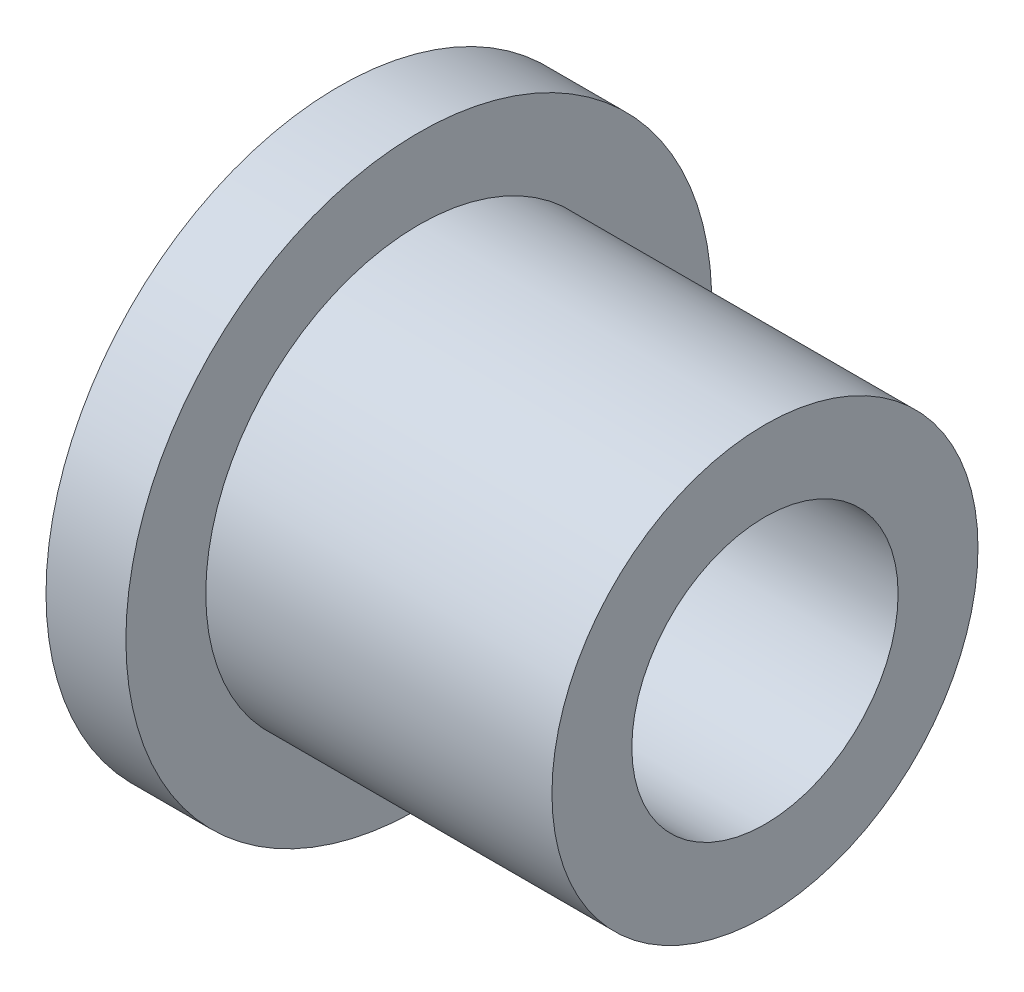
ISO-10303-21;
HEADER;
FILE_DESCRIPTION(('STEP AP214'),'2;1');
FILE_NAME('part.step','',(''),(''),'','','');
FILE_SCHEMA(('AUTOMOTIVE_DESIGN { 1 0 10303 214 1 1 1 1 }'));
ENDSEC;
DATA;
#1=APPLICATION_CONTEXT('core data for automotive mechanical design processes');
#2=APPLICATION_PROTOCOL_DEFINITION('international standard','automotive_design',2000,#1);
#3=PRODUCT_CONTEXT('',#1,'mechanical');
#4=PRODUCT('Part','Part','',(#3));
#5=PRODUCT_RELATED_PRODUCT_CATEGORY('part','',(#4));
#6=PRODUCT_DEFINITION_FORMATION('','',#4);
#7=PRODUCT_DEFINITION_CONTEXT('part definition',#1,'design');
#8=PRODUCT_DEFINITION('design','',#6,#7);
#9=PRODUCT_DEFINITION_SHAPE('','',#8);
#10=(LENGTH_UNIT() NAMED_UNIT(*) SI_UNIT(.MILLI.,.METRE.));
#11=(NAMED_UNIT(*) PLANE_ANGLE_UNIT() SI_UNIT($,.RADIAN.));
#12=(NAMED_UNIT(*) SI_UNIT($,.STERADIAN.) SOLID_ANGLE_UNIT());
#13=UNCERTAINTY_MEASURE_WITH_UNIT(LENGTH_MEASURE(1.E-05),#10,'distance_accuracy_value','');
#14=(GEOMETRIC_REPRESENTATION_CONTEXT(3) GLOBAL_UNCERTAINTY_ASSIGNED_CONTEXT((#13)) GLOBAL_UNIT_ASSIGNED_CONTEXT((#10,
#11,#12)) REPRESENTATION_CONTEXT('',''));
#15=CARTESIAN_POINT('',(0.,0.,0.));
#16=DIRECTION('',(0.,0.,1.));
#17=DIRECTION('',(1.,0.,0.));
#18=AXIS2_PLACEMENT_3D('',#15,#16,#17);
#19=CARTESIAN_POINT('',(-88.99,0.,0.));
#20=DIRECTION('',(-1.,0.,0.));
#21=DIRECTION('',(0.,0.,0.999999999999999));
#22=AXIS2_PLACEMENT_3D('',#19,#20,#21);
#23=CYLINDRICAL_SURFACE('',#22,11.);
#24=CARTESIAN_POINT('',(0.,0.,0.));
#25=DIRECTION('',(-1.,0.,0.));
#26=DIRECTION('',(0.,0.,0.999999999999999));
#27=AXIS2_PLACEMENT_3D('',#24,#25,#26);
#28=CIRCLE('',#27,11.);
#29=CARTESIAN_POINT('',(0.,0.,11.));
#30=VERTEX_POINT('',#29);
#31=EDGE_CURVE('E12',#30,#30,#28,.T.);
#32=ORIENTED_EDGE('',*,*,#31,.F.);
#33=EDGE_LOOP('',(#32));
#34=FACE_BOUND('',#33,.T.);
#35=CARTESIAN_POINT('',(3.,0.,0.));
#36=DIRECTION('',(-1.,0.,0.));
#37=DIRECTION('',(0.,0.,0.999999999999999));
#38=AXIS2_PLACEMENT_3D('',#35,#36,#37);
#39=CIRCLE('',#38,11.);
#40=CARTESIAN_POINT('',(3.,0.,11.));
#41=VERTEX_POINT('',#40);
#42=EDGE_CURVE('E60',#41,#41,#39,.T.);
#43=ORIENTED_EDGE('',*,*,#42,.T.);
#44=EDGE_LOOP('',(#43));
#45=FACE_BOUND('',#44,.T.);
#46=ADVANCED_FACE('F38',(#34,#45),#23,.T.);
#47=CARTESIAN_POINT('',(0.,11.,0.));
#48=DIRECTION('',(1.,0.,0.));
#49=DIRECTION('',(0.,0.,-0.999999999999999));
#50=AXIS2_PLACEMENT_3D('',#47,#48,#49);
#51=PLANE('',#50);
#52=CARTESIAN_POINT('',(0.,0.,0.));
#53=DIRECTION('',(-1.,0.,0.));
#54=DIRECTION('',(0.,0.,0.999999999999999));
#55=AXIS2_PLACEMENT_3D('',#52,#53,#54);
#56=CIRCLE('',#55,5.);
#57=CARTESIAN_POINT('',(0.,0.,4.99999999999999));
#58=VERTEX_POINT('',#57);
#59=EDGE_CURVE('E44',#58,#58,#56,.T.);
#60=ORIENTED_EDGE('',*,*,#59,.F.);
#61=EDGE_LOOP('',(#60));
#62=FACE_BOUND('',#61,.T.);
#63=ORIENTED_EDGE('',*,*,#31,.T.);
#64=EDGE_LOOP('',(#63));
#65=FACE_BOUND('',#64,.T.);
#66=ADVANCED_FACE('F85',(#62,#65),#51,.F.);
#67=CARTESIAN_POINT('',(-88.99,0.,0.));
#68=DIRECTION('',(-1.,0.,0.));
#69=DIRECTION('',(0.,0.,0.999999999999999));
#70=AXIS2_PLACEMENT_3D('',#67,#68,#69);
#71=CYLINDRICAL_SURFACE('',#70,5.);
#72=CARTESIAN_POINT('',(16.,0.,0.));
#73=DIRECTION('',(-1.,0.,0.));
#74=DIRECTION('',(0.,0.,0.999999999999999));
#75=AXIS2_PLACEMENT_3D('',#72,#73,#74);
#76=CIRCLE('',#75,5.);
#77=CARTESIAN_POINT('',(16.,0.,4.99999999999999));
#78=VERTEX_POINT('',#77);
#79=EDGE_CURVE('E48',#78,#78,#76,.T.);
#80=ORIENTED_EDGE('',*,*,#79,.F.);
#81=EDGE_LOOP('',(#80));
#82=FACE_BOUND('',#81,.T.);
#83=ORIENTED_EDGE('',*,*,#59,.T.);
#84=EDGE_LOOP('',(#83));
#85=FACE_BOUND('',#84,.T.);
#86=ADVANCED_FACE('F80',(#82,#85),#71,.F.);
#87=CARTESIAN_POINT('',(16.,5.,0.));
#88=DIRECTION('',(-1.,0.,0.));
#89=DIRECTION('',(0.,0.,0.999999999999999));
#90=AXIS2_PLACEMENT_3D('',#87,#88,#89);
#91=PLANE('',#90);
#92=CARTESIAN_POINT('',(16.,0.,0.));
#93=DIRECTION('',(-1.,0.,0.));
#94=DIRECTION('',(0.,0.,0.999999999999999));
#95=AXIS2_PLACEMENT_3D('',#92,#93,#94);
#96=CIRCLE('',#95,8.);
#97=CARTESIAN_POINT('',(16.,0.,7.99999999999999));
#98=VERTEX_POINT('',#97);
#99=EDGE_CURVE('E52',#98,#98,#96,.T.);
#100=ORIENTED_EDGE('',*,*,#99,.F.);
#101=EDGE_LOOP('',(#100));
#102=FACE_BOUND('',#101,.T.);
#103=ORIENTED_EDGE('',*,*,#79,.T.);
#104=EDGE_LOOP('',(#103));
#105=FACE_BOUND('',#104,.T.);
#106=ADVANCED_FACE('F74',(#102,#105),#91,.F.);
#107=CARTESIAN_POINT('',(-88.99,0.,0.));
#108=DIRECTION('',(-1.,0.,0.));
#109=DIRECTION('',(0.,0.,0.999999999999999));
#110=AXIS2_PLACEMENT_3D('',#107,#108,#109);
#111=CYLINDRICAL_SURFACE('',#110,8.);
#112=CARTESIAN_POINT('',(3.,0.,0.));
#113=DIRECTION('',(-1.,0.,0.));
#114=DIRECTION('',(0.,0.,0.999999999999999));
#115=AXIS2_PLACEMENT_3D('',#112,#113,#114);
#116=CIRCLE('',#115,8.);
#117=CARTESIAN_POINT('',(3.,0.,7.99999999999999));
#118=VERTEX_POINT('',#117);
#119=EDGE_CURVE('E57',#118,#118,#116,.T.);
#120=ORIENTED_EDGE('',*,*,#119,.F.);
#121=EDGE_LOOP('',(#120));
#122=FACE_BOUND('',#121,.T.);
#123=ORIENTED_EDGE('',*,*,#99,.T.);
#124=EDGE_LOOP('',(#123));
#125=FACE_BOUND('',#124,.T.);
#126=ADVANCED_FACE('F68',(#122,#125),#111,.T.);
#127=CARTESIAN_POINT('',(3.,8.,0.));
#128=DIRECTION('',(-1.,0.,0.));
#129=DIRECTION('',(0.,0.,0.999999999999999));
#130=AXIS2_PLACEMENT_3D('',#127,#128,#129);
#131=PLANE('',#130);
#132=ORIENTED_EDGE('',*,*,#42,.F.);
#133=EDGE_LOOP('',(#132));
#134=FACE_BOUND('',#133,.T.);
#135=ORIENTED_EDGE('',*,*,#119,.T.);
#136=EDGE_LOOP('',(#135));
#137=FACE_BOUND('',#136,.T.);
#138=ADVANCED_FACE('F65',(#134,#137),#131,.F.);
#139=CLOSED_SHELL('',(#46,#66,#86,#106,#126,#138));
#140=MANIFOLD_SOLID_BREP('B2',#139);
#141=ADVANCED_BREP_SHAPE_REPRESENTATION('',(#18,#140),#14);
#142=SHAPE_DEFINITION_REPRESENTATION(#9,#141);
ENDSEC;
END-ISO-10303-21;
